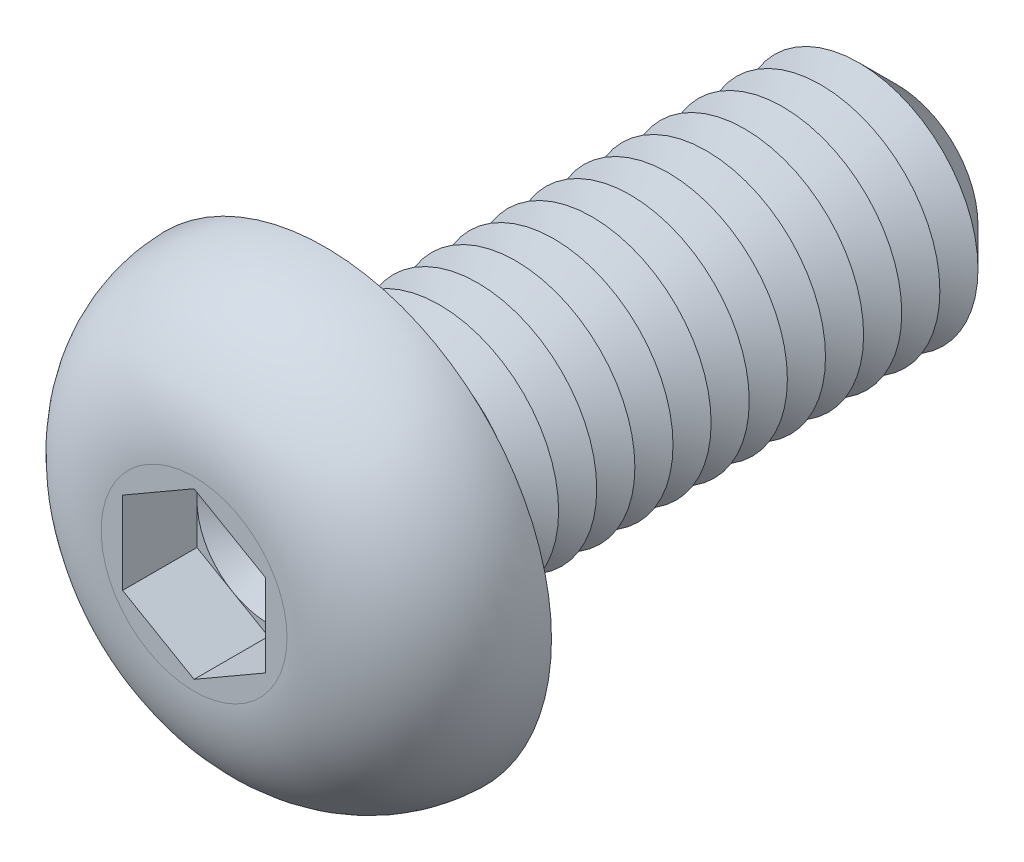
from build123d import *

# Parameters (mm, degrees)
CUT_EXTRUDE1_DEPTH  = 1.56
SKETCH4_R           = 2.5
BOSS_EXTRUDE1_DEPTH = 12
CHAMFER1_SIZE       = 0.8
LPATTERN1_COUNT     = 13
LPATTERN1_PITCH     = 0.8
FILLET2_R           = 0.4


with BuildPart() as part:
    # Sketch2 → Revolve1 (revolve)
    with BuildSketch(Plane(origin=(0, 0, 0), x_dir=(0, 0, -1), z_dir=(1, 0, 0)), mode=Mode.PRIVATE) as revolve1_sk:
        with BuildLine():
            Line((0, 0), (-2.75, 0))
            Line((-2.75, 0), (-2.75, 1.950446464))
            ThreePointArc((-2.75, 1.950446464), (-1.947498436, 3.912588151), (0, 4.75))
            Line((0, 4.75), (0, 0))
        make_face()
    revolve(revolve1_sk.sketch.rotate(Axis((0, 0, 47.934239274), (0, 0, -1)), 90), axis=Axis((0, 0, 47.934239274), (0, 0, -1)))

    # Sketch3 → Cut-Extrude1 (cut)
    with BuildSketch(Plane.XY.offset(2.75)):
        Polygon((0, 1.732050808), (-1.5, 0.866025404), (-1.5, -0.866025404), (0, -1.732050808), (1.5, -0.866025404), (1.5, 0.866025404), align=None)
    extrude(amount=-CUT_EXTRUDE1_DEPTH, mode=Mode.SUBTRACT)

    # Sketch4 → Boss-Extrude1 (add)
    with BuildSketch(Plane(origin=(0, 0, 0), x_dir=(-1, 0, 0), z_dir=(0, 0, -1))):
        with Locations(Location((0, 0, 0), (0, 0, 180))):
            Circle(SKETCH4_R)
    extrude(amount=BOSS_EXTRUDE1_DEPTH)

    # Chamfer1
    chamfer1_edges = [part.edges().sort_by_distance(p)[0] for p in [
        (-2.5, 0, -12),
    ]]
    chamfer(chamfer1_edges, length=CHAMFER1_SIZE)

    # Sketch5 → Cut-Revolve1 (revolve, cut)
    with BuildSketch(Plane(origin=(0, 0, 0), x_dir=(0, 0, -1), z_dir=(1, 0, 0)), mode=Mode.PRIVATE) as cut_revolve1_sk:
        Polygon((0.8, 2.5), (1.6, 2.5), (1.2, 1.807179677), align=None)
    cut_revolve1 = revolve(cut_revolve1_sk.sketch.rotate(Axis((0, 0, 47.934239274), (0, 0, -1)), 90), axis=Axis((0, 0, 47.934239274), (0, 0, -1)), mode=Mode.SUBTRACT)

    # LPattern1: Cut-Revolve1 ×13
    with Locations(*[(0, 0, -i * LPATTERN1_PITCH) for i in range(1, LPATTERN1_COUNT)]):
        add(cut_revolve1, mode=Mode.SUBTRACT)

    # Fillet2
    fillet2_edges = [part.edges().sort_by_distance(p)[0] for p in [
        (-2.5, 0, 0),
    ]]
    fillet(fillet2_edges, radius=FILLET2_R)

    # Cut-Extrude2 cone 1 section (on through the dimple's axis) → Cut-Extrude2 (revolve, cut)
    with BuildSketch(Plane(origin=(0, 0, 1.19), x_dir=(0, -1, 0), z_dir=(1, 0, 0))):
        Polygon((0, 0), (1.5, 0), (0, 0.866025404), align=None)
    revolve(axis=Axis((0, 0, 1.19), (0, 0, -1)), mode=Mode.SUBTRACT)


solid = part.part
